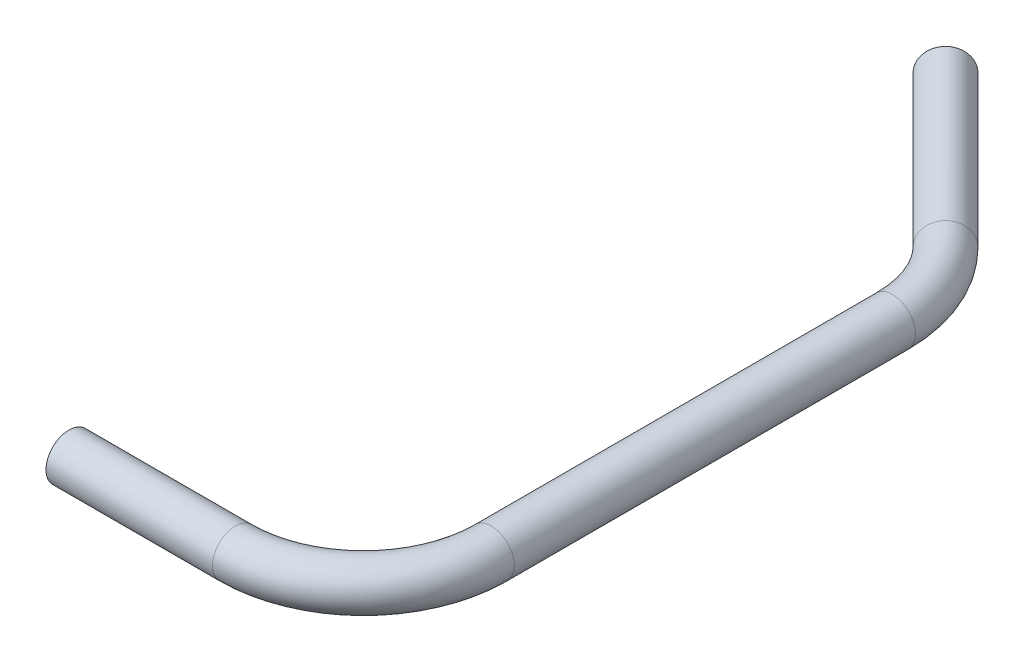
ISO-10303-21;
HEADER;
FILE_DESCRIPTION(('STEP AP214'),'2;1');
FILE_NAME('part.step','',(''),(''),'','','');
FILE_SCHEMA(('AUTOMOTIVE_DESIGN { 1 0 10303 214 1 1 1 1 }'));
ENDSEC;
DATA;
#1=APPLICATION_CONTEXT('core data for automotive mechanical design processes');
#2=APPLICATION_PROTOCOL_DEFINITION('international standard','automotive_design',2000,#1);
#3=PRODUCT_CONTEXT('',#1,'mechanical');
#4=PRODUCT('Part','Part','',(#3));
#5=PRODUCT_RELATED_PRODUCT_CATEGORY('part','',(#4));
#6=PRODUCT_DEFINITION_FORMATION('','',#4);
#7=PRODUCT_DEFINITION_CONTEXT('part definition',#1,'design');
#8=PRODUCT_DEFINITION('design','',#6,#7);
#9=PRODUCT_DEFINITION_SHAPE('','',#8);
#10=(LENGTH_UNIT() NAMED_UNIT(*) SI_UNIT(.MILLI.,.METRE.));
#11=(NAMED_UNIT(*) PLANE_ANGLE_UNIT() SI_UNIT($,.RADIAN.));
#12=(NAMED_UNIT(*) SI_UNIT($,.STERADIAN.) SOLID_ANGLE_UNIT());
#13=UNCERTAINTY_MEASURE_WITH_UNIT(LENGTH_MEASURE(1.E-05),#10,'distance_accuracy_value','');
#14=(GEOMETRIC_REPRESENTATION_CONTEXT(3) GLOBAL_UNCERTAINTY_ASSIGNED_CONTEXT((#13)) GLOBAL_UNIT_ASSIGNED_CONTEXT((#10,
#11,#12)) REPRESENTATION_CONTEXT('',''));
#15=CARTESIAN_POINT('',(0.,0.,0.));
#16=DIRECTION('',(0.,0.,1.));
#17=DIRECTION('',(1.,0.,0.));
#18=AXIS2_PLACEMENT_3D('',#15,#16,#17);
#19=CARTESIAN_POINT('',(97.5,0.,-75.));
#20=DIRECTION('',(0.,1.,0.));
#21=DIRECTION('',(0.,0.,-1.));
#22=AXIS2_PLACEMENT_3D('',#19,#20,#21);
#23=TOROIDAL_SURFACE('',#22,75.,11.15);
#24=CARTESIAN_POINT('',(172.5,0.,-75.));
#25=DIRECTION('',(0.,0.,-1.));
#26=DIRECTION('',(1.,0.,0.));
#27=AXIS2_PLACEMENT_3D('',#24,#25,#26);
#28=CIRCLE('',#27,11.15);
#29=CARTESIAN_POINT('',(183.65,0.,-75.));
#30=VERTEX_POINT('',#29);
#31=EDGE_CURVE('E97',#30,#30,#28,.F.);
#32=ORIENTED_EDGE('',*,*,#31,.F.);
#33=EDGE_LOOP('',(#32));
#34=FACE_BOUND('',#33,.T.);
#35=CARTESIAN_POINT('',(97.5,0.,0.));
#36=DIRECTION('',(1.,0.,0.));
#37=DIRECTION('',(0.,0.,1.));
#38=AXIS2_PLACEMENT_3D('',#35,#36,#37);
#39=CIRCLE('',#38,11.15);
#40=CARTESIAN_POINT('',(97.5,0.,11.15));
#41=VERTEX_POINT('',#40);
#42=EDGE_CURVE('E105',#41,#41,#39,.T.);
#43=ORIENTED_EDGE('',*,*,#42,.F.);
#44=EDGE_LOOP('',(#43));
#45=FACE_BOUND('',#44,.T.);
#46=ADVANCED_FACE('F39',(#34,#45),#23,.F.);
#47=CARTESIAN_POINT('',(97.5,0.,0.));
#48=DIRECTION('',(-1.,0.,0.));
#49=DIRECTION('',(0.,0.,1.));
#50=AXIS2_PLACEMENT_3D('',#47,#48,#49);
#51=CYLINDRICAL_SURFACE('',#50,11.15);
#52=ORIENTED_EDGE('',*,*,#42,.T.);
#53=EDGE_LOOP('',(#52));
#54=FACE_BOUND('',#53,.T.);
#55=CARTESIAN_POINT('',(0.,0.,0.));
#56=DIRECTION('',(-1.,0.,0.));
#57=DIRECTION('',(0.,0.,1.));
#58=AXIS2_PLACEMENT_3D('',#55,#56,#57);
#59=CIRCLE('',#58,11.15);
#60=CARTESIAN_POINT('',(0.,0.,11.15));
#61=VERTEX_POINT('',#60);
#62=EDGE_CURVE('E159',#61,#61,#59,.T.);
#63=ORIENTED_EDGE('',*,*,#62,.T.);
#64=EDGE_LOOP('',(#63));
#65=FACE_BOUND('',#64,.T.);
#66=ADVANCED_FACE('F125',(#54,#65),#51,.F.);
#67=CARTESIAN_POINT('',(62.14466094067,0.,-451.4213562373));
#68=DIRECTION('',(-0.707106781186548,0.,-0.707106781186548));
#69=DIRECTION('',(-0.707106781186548,0.,0.707106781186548));
#70=AXIS2_PLACEMENT_3D('',#67,#68,#69);
#71=PLANE('',#70);
#72=CARTESIAN_POINT('',(62.14466094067,0.,-451.42135623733));
#73=DIRECTION('',(-0.707106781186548,0.,-0.707106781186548));
#74=DIRECTION('',(-0.707106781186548,0.,0.707106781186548));
#75=AXIS2_PLACEMENT_3D('',#72,#73,#74);
#76=CIRCLE('',#75,11.15);
#77=CARTESIAN_POINT('',(54.26042033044,0.,-443.5371156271));
#78=VERTEX_POINT('',#77);
#79=EDGE_CURVE('E60',#78,#78,#76,.F.);
#80=ORIENTED_EDGE('',*,*,#79,.T.);
#81=EDGE_LOOP('',(#80));
#82=FACE_BOUND('',#81,.T.);
#83=CARTESIAN_POINT('',(62.144660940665,0.,-451.421356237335));
#84=DIRECTION('',(-0.707106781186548,0.,-0.707106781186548));
#85=DIRECTION('',(-0.707106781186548,0.,0.707106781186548));
#86=AXIS2_PLACEMENT_3D('',#83,#84,#85);
#87=CIRCLE('',#86,13.45);
#88=CARTESIAN_POINT('',(52.6340747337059,0.,-441.910770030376));
#89=VERTEX_POINT('',#88);
#90=EDGE_CURVE('E43',#89,#89,#87,.F.);
#91=ORIENTED_EDGE('',*,*,#90,.F.);
#92=EDGE_LOOP('',(#91));
#93=FACE_BOUND('',#92,.T.);
#94=ADVANCED_FACE('F41',(#82,#93),#71,.T.);
#95=CARTESIAN_POINT('',(150.533008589,0.,-363.033008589));
#96=DIRECTION('',(-0.707106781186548,0.,-0.707106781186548));
#97=DIRECTION('',(-0.707106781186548,0.,0.707106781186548));
#98=AXIS2_PLACEMENT_3D('',#95,#96,#97);
#99=CYLINDRICAL_SURFACE('',#98,13.45);
#100=ORIENTED_EDGE('',*,*,#90,.T.);
#101=EDGE_LOOP('',(#100));
#102=FACE_BOUND('',#101,.T.);
#103=CARTESIAN_POINT('',(150.533008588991,0.,-363.033008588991));
#104=DIRECTION('',(-0.707106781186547,0.,-0.707106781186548));
#105=DIRECTION('',(0.707106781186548,0.,-0.707106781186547));
#106=AXIS2_PLACEMENT_3D('',#103,#104,#105);
#107=CIRCLE('',#106,13.45);
#108=CARTESIAN_POINT('',(160.04359479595,0.,-372.54359479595));
#109=VERTEX_POINT('',#108);
#110=EDGE_CURVE('E76',#109,#109,#107,.F.);
#111=ORIENTED_EDGE('',*,*,#110,.F.);
#112=EDGE_LOOP('',(#111));
#113=FACE_BOUND('',#112,.T.);
#114=ADVANCED_FACE('F132',(#102,#113),#99,.T.);
#115=CARTESIAN_POINT('',(97.5,0.,-310.));
#116=DIRECTION('',(0.,1.,0.));
#117=DIRECTION('',(-1.,0.,0.));
#118=AXIS2_PLACEMENT_3D('',#115,#116,#117);
#119=TOROIDAL_SURFACE('',#118,75.,13.45);
#120=ORIENTED_EDGE('',*,*,#110,.T.);
#121=EDGE_LOOP('',(#120));
#122=FACE_BOUND('',#121,.T.);
#123=CARTESIAN_POINT('',(172.5,0.,-310.));
#124=DIRECTION('',(0.,0.,-1.));
#125=DIRECTION('',(-1.,0.,0.));
#126=AXIS2_PLACEMENT_3D('',#123,#124,#125);
#127=CIRCLE('',#126,13.45);
#128=CARTESIAN_POINT('',(159.05,0.,-310.));
#129=VERTEX_POINT('',#128);
#130=EDGE_CURVE('E48',#129,#129,#127,.F.);
#131=ORIENTED_EDGE('',*,*,#130,.F.);
#132=EDGE_LOOP('',(#131));
#133=FACE_BOUND('',#132,.T.);
#134=ADVANCED_FACE('F128',(#122,#133),#119,.T.);
#135=CARTESIAN_POINT('',(97.5,0.,-75.));
#136=DIRECTION('',(0.,1.,0.));
#137=DIRECTION('',(0.,0.,-1.));
#138=AXIS2_PLACEMENT_3D('',#135,#136,#137);
#139=TOROIDAL_SURFACE('',#138,75.,13.45);
#140=CARTESIAN_POINT('',(172.5,0.,-75.));
#141=DIRECTION('',(0.,0.,-1.));
#142=DIRECTION('',(-1.,0.,0.));
#143=AXIS2_PLACEMENT_3D('',#140,#141,#142);
#144=CIRCLE('',#143,13.45);
#145=CARTESIAN_POINT('',(159.05,0.,-75.));
#146=VERTEX_POINT('',#145);
#147=EDGE_CURVE('E11',#146,#146,#144,.T.);
#148=ORIENTED_EDGE('',*,*,#147,.F.);
#149=EDGE_LOOP('',(#148));
#150=FACE_BOUND('',#149,.T.);
#151=CARTESIAN_POINT('',(97.5,0.,0.));
#152=DIRECTION('',(1.,0.,0.));
#153=DIRECTION('',(0.,0.,1.));
#154=AXIS2_PLACEMENT_3D('',#151,#152,#153);
#155=CIRCLE('',#154,13.45);
#156=CARTESIAN_POINT('',(97.5,0.,13.45));
#157=VERTEX_POINT('',#156);
#158=EDGE_CURVE('E56',#157,#157,#155,.T.);
#159=ORIENTED_EDGE('',*,*,#158,.T.);
#160=EDGE_LOOP('',(#159));
#161=FACE_BOUND('',#160,.T.);
#162=ADVANCED_FACE('F123',(#150,#161),#139,.T.);
#163=CARTESIAN_POINT('',(172.5,0.,-75.));
#164=DIRECTION('',(0.,0.,-1.));
#165=DIRECTION('',(-1.,0.,0.));
#166=AXIS2_PLACEMENT_3D('',#163,#164,#165);
#167=CYLINDRICAL_SURFACE('',#166,13.45);
#168=ORIENTED_EDGE('',*,*,#130,.T.);
#169=EDGE_LOOP('',(#168));
#170=FACE_BOUND('',#169,.T.);
#171=ORIENTED_EDGE('',*,*,#147,.T.);
#172=EDGE_LOOP('',(#171));
#173=FACE_BOUND('',#172,.T.);
#174=ADVANCED_FACE('F119',(#170,#173),#167,.T.);
#175=CARTESIAN_POINT('',(150.533008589,0.,-363.033008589));
#176=DIRECTION('',(-0.707106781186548,0.,-0.707106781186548));
#177=DIRECTION('',(-0.707106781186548,0.,0.707106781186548));
#178=AXIS2_PLACEMENT_3D('',#175,#176,#177);
#179=CYLINDRICAL_SURFACE('',#178,11.15);
#180=ORIENTED_EDGE('',*,*,#79,.F.);
#181=EDGE_LOOP('',(#180));
#182=FACE_BOUND('',#181,.T.);
#183=CARTESIAN_POINT('',(150.533008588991,0.,-363.033008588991));
#184=DIRECTION('',(-0.707106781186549,0.,-0.707106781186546));
#185=DIRECTION('',(0.707106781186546,0.,-0.707106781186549));
#186=AXIS2_PLACEMENT_3D('',#183,#184,#185);
#187=CIRCLE('',#186,11.15);
#188=CARTESIAN_POINT('',(158.417249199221,0.,-370.917249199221));
#189=VERTEX_POINT('',#188);
#190=EDGE_CURVE('E90',#189,#189,#187,.T.);
#191=ORIENTED_EDGE('',*,*,#190,.F.);
#192=EDGE_LOOP('',(#191));
#193=FACE_BOUND('',#192,.T.);
#194=ADVANCED_FACE('F115',(#182,#193),#179,.F.);
#195=CARTESIAN_POINT('',(97.5,0.,-310.));
#196=DIRECTION('',(0.,1.,0.));
#197=DIRECTION('',(-1.,0.,0.));
#198=AXIS2_PLACEMENT_3D('',#195,#196,#197);
#199=TOROIDAL_SURFACE('',#198,75.,11.15);
#200=ORIENTED_EDGE('',*,*,#190,.T.);
#201=EDGE_LOOP('',(#200));
#202=FACE_BOUND('',#201,.T.);
#203=CARTESIAN_POINT('',(172.5,0.,-310.));
#204=DIRECTION('',(0.,0.,1.));
#205=DIRECTION('',(1.,0.,0.));
#206=AXIS2_PLACEMENT_3D('',#203,#204,#205);
#207=CIRCLE('',#206,11.15);
#208=CARTESIAN_POINT('',(183.65,0.,-310.));
#209=VERTEX_POINT('',#208);
#210=EDGE_CURVE('E165',#209,#209,#207,.T.);
#211=ORIENTED_EDGE('',*,*,#210,.T.);
#212=EDGE_LOOP('',(#211));
#213=FACE_BOUND('',#212,.T.);
#214=ADVANCED_FACE('F110',(#202,#213),#199,.F.);
#215=CARTESIAN_POINT('',(0.,0.,0.));
#216=DIRECTION('',(1.,0.,0.));
#217=DIRECTION('',(0.,0.,-1.));
#218=AXIS2_PLACEMENT_3D('',#215,#216,#217);
#219=CYLINDRICAL_SURFACE('',#218,13.45);
#220=CARTESIAN_POINT('',(0.,0.,0.));
#221=DIRECTION('',(-1.,0.,0.));
#222=DIRECTION('',(0.,0.,1.));
#223=AXIS2_PLACEMENT_3D('',#220,#221,#222);
#224=CIRCLE('',#223,13.45);
#225=CARTESIAN_POINT('',(0.,0.,13.45));
#226=VERTEX_POINT('',#225);
#227=EDGE_CURVE('E153',#226,#226,#224,.T.);
#228=ORIENTED_EDGE('',*,*,#227,.F.);
#229=EDGE_LOOP('',(#228));
#230=FACE_BOUND('',#229,.T.);
#231=ORIENTED_EDGE('',*,*,#158,.F.);
#232=EDGE_LOOP('',(#231));
#233=FACE_BOUND('',#232,.T.);
#234=ADVANCED_FACE('F114',(#230,#233),#219,.T.);
#235=CARTESIAN_POINT('',(0.,0.,0.));
#236=DIRECTION('',(-1.,0.,0.));
#237=DIRECTION('',(0.,0.,1.));
#238=AXIS2_PLACEMENT_3D('',#235,#236,#237);
#239=PLANE('',#238);
#240=ORIENTED_EDGE('',*,*,#62,.F.);
#241=EDGE_LOOP('',(#240));
#242=FACE_BOUND('',#241,.T.);
#243=ORIENTED_EDGE('',*,*,#227,.T.);
#244=EDGE_LOOP('',(#243));
#245=FACE_BOUND('',#244,.T.);
#246=ADVANCED_FACE('F174',(#242,#245),#239,.T.);
#247=CARTESIAN_POINT('',(172.5,0.,-310.));
#248=DIRECTION('',(0.,0.,1.));
#249=DIRECTION('',(1.,0.,0.));
#250=AXIS2_PLACEMENT_3D('',#247,#248,#249);
#251=CYLINDRICAL_SURFACE('',#250,11.15);
#252=ORIENTED_EDGE('',*,*,#210,.F.);
#253=EDGE_LOOP('',(#252));
#254=FACE_BOUND('',#253,.T.);
#255=ORIENTED_EDGE('',*,*,#31,.T.);
#256=EDGE_LOOP('',(#255));
#257=FACE_BOUND('',#256,.T.);
#258=ADVANCED_FACE('F171',(#254,#257),#251,.F.);
#259=CLOSED_SHELL('',(#46,#66,#94,#114,#134,#162,#174,#194,#214,#234,#246,#258));
#260=MANIFOLD_SOLID_BREP('B2',#259);
#261=ADVANCED_BREP_SHAPE_REPRESENTATION('',(#18,#260),#14);
#262=SHAPE_DEFINITION_REPRESENTATION(#9,#261);
ENDSEC;
END-ISO-10303-21;
